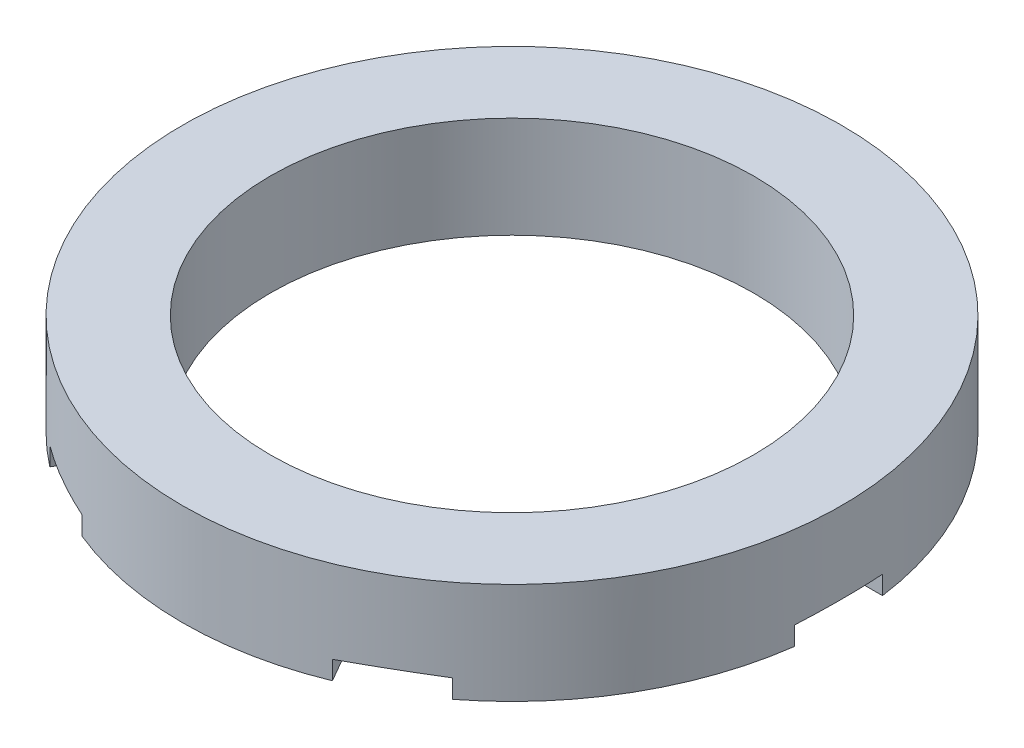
ISO-10303-21;
HEADER;
FILE_DESCRIPTION(('STEP AP214'),'2;1');
FILE_NAME('part.step','',(''),(''),'','','');
FILE_SCHEMA(('AUTOMOTIVE_DESIGN { 1 0 10303 214 1 1 1 1 }'));
ENDSEC;
DATA;
#1=APPLICATION_CONTEXT('core data for automotive mechanical design processes');
#2=APPLICATION_PROTOCOL_DEFINITION('international standard','automotive_design',2000,#1);
#3=PRODUCT_CONTEXT('',#1,'mechanical');
#4=PRODUCT('Part','Part','',(#3));
#5=PRODUCT_RELATED_PRODUCT_CATEGORY('part','',(#4));
#6=PRODUCT_DEFINITION_FORMATION('','',#4);
#7=PRODUCT_DEFINITION_CONTEXT('part definition',#1,'design');
#8=PRODUCT_DEFINITION('design','',#6,#7);
#9=PRODUCT_DEFINITION_SHAPE('','',#8);
#10=(LENGTH_UNIT() NAMED_UNIT(*) SI_UNIT(.MILLI.,.METRE.));
#11=(NAMED_UNIT(*) PLANE_ANGLE_UNIT() SI_UNIT($,.RADIAN.));
#12=(NAMED_UNIT(*) SI_UNIT($,.STERADIAN.) SOLID_ANGLE_UNIT());
#13=UNCERTAINTY_MEASURE_WITH_UNIT(LENGTH_MEASURE(1.E-05),#10,'distance_accuracy_value','');
#14=(GEOMETRIC_REPRESENTATION_CONTEXT(3) GLOBAL_UNCERTAINTY_ASSIGNED_CONTEXT((#13)) GLOBAL_UNIT_ASSIGNED_CONTEXT((#10,
#11,#12)) REPRESENTATION_CONTEXT('',''));
#15=CARTESIAN_POINT('',(0.,0.,0.));
#16=DIRECTION('',(0.,0.,1.));
#17=DIRECTION('',(1.,0.,0.));
#18=AXIS2_PLACEMENT_3D('',#15,#16,#17);
#19=CARTESIAN_POINT('',(0.,0.,0.));
#20=DIRECTION('',(0.,1.,0.));
#21=DIRECTION('',(0.,0.,1.));
#22=AXIS2_PLACEMENT_3D('',#19,#20,#21);
#23=PLANE('',#22);
#24=CARTESIAN_POINT('',(0.,0.,0.));
#25=DIRECTION('',(0.,1.,0.));
#26=DIRECTION('',(0.,0.,1.));
#27=AXIS2_PLACEMENT_3D('',#24,#25,#26);
#28=CIRCLE('',#27,27.5);
#29=CARTESIAN_POINT('',(0.,0.,27.5));
#30=VERTEX_POINT('',#29);
#31=EDGE_CURVE('E244',#30,#30,#28,.T.);
#32=ORIENTED_EDGE('',*,*,#31,.T.);
#33=EDGE_LOOP('',(#32));
#34=FACE_BOUND('',#33,.T.);
#35=DIRECTION('',(0.50000000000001,0.,0.866025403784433));
#36=VECTOR('',#35,1.);
#37=CARTESIAN_POINT('',(-12.4193542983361,0.,-31.5109526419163));
#38=LINE('',#37,#36);
#39=CARTESIAN_POINT('',(-14.2524589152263,0.,-34.6859829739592));
#40=VERTEX_POINT('',#39);
#41=CARTESIAN_POINT('',(-12.4193542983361,0.,-31.5109526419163));
#42=VERTEX_POINT('',#41);
#43=EDGE_CURVE('E159',#40,#42,#38,.T.);
#44=ORIENTED_EDGE('',*,*,#43,.F.);
#45=CARTESIAN_POINT('',(0.,0.,0.));
#46=DIRECTION('',(0.,1.,0.));
#47=DIRECTION('',(0.,0.,1.));
#48=AXIS2_PLACEMENT_3D('',#45,#46,#47);
#49=CIRCLE('',#48,37.5);
#50=CARTESIAN_POINT('',(14.2524589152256,0.,-34.6859829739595));
#51=VERTEX_POINT('',#50);
#52=EDGE_CURVE('E300',#51,#40,#49,.T.);
#53=ORIENTED_EDGE('',*,*,#52,.F.);
#54=DIRECTION('',(-0.499999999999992,0.,0.866025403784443));
#55=VECTOR('',#54,1.);
#56=CARTESIAN_POINT('',(12.4193542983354,0.,-31.5109526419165));
#57=LINE('',#56,#55);
#58=CARTESIAN_POINT('',(12.4193542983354,0.,-31.5109526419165));
#59=VERTEX_POINT('',#58);
#60=EDGE_CURVE('E56',#51,#59,#57,.T.);
#61=ORIENTED_EDGE('',*,*,#60,.T.);
#62=DIRECTION('',(-0.866025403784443,0.,-0.499999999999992));
#63=VECTOR('',#62,1.);
#64=CARTESIAN_POINT('',(21.0796083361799,0.,-26.5109526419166));
#65=LINE('',#64,#63);
#66=CARTESIAN_POINT('',(21.0796083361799,0.,-26.5109526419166));
#67=VERTEX_POINT('',#66);
#68=EDGE_CURVE('E187',#67,#59,#65,.T.);
#69=ORIENTED_EDGE('',*,*,#68,.F.);
#70=DIRECTION('',(-0.499999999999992,0.,0.866025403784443));
#71=VECTOR('',#70,1.);
#72=CARTESIAN_POINT('',(21.0796083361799,0.,-26.5109526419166));
#73=LINE('',#72,#71);
#74=CARTESIAN_POINT('',(22.9127129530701,0.,-29.6859829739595));
#75=VERTEX_POINT('',#74);
#76=EDGE_CURVE('E183',#75,#67,#73,.T.);
#77=ORIENTED_EDGE('',*,*,#76,.F.);
#78=CARTESIAN_POINT('',(37.1651718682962,0.,-5.00000000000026));
#79=VERTEX_POINT('',#78);
#80=EDGE_CURVE('E301',#79,#75,#49,.T.);
#81=ORIENTED_EDGE('',*,*,#80,.F.);
#82=DIRECTION('',(-1.,0.,0.));
#83=VECTOR('',#82,1.);
#84=CARTESIAN_POINT('',(33.4989626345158,0.,-5.00000000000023));
#85=LINE('',#84,#83);
#86=CARTESIAN_POINT('',(33.4989626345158,0.,-5.00000000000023));
#87=VERTEX_POINT('',#86);
#88=EDGE_CURVE('E192',#79,#87,#85,.T.);
#89=ORIENTED_EDGE('',*,*,#88,.T.);
#90=DIRECTION('',(0.,0.,-1.));
#91=VECTOR('',#90,1.);
#92=CARTESIAN_POINT('',(33.4989626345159,0.,4.99999999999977));
#93=LINE('',#92,#91);
#94=CARTESIAN_POINT('',(33.4989626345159,0.,4.99999999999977));
#95=VERTEX_POINT('',#94);
#96=EDGE_CURVE('E199',#95,#87,#93,.T.);
#97=ORIENTED_EDGE('',*,*,#96,.F.);
#98=DIRECTION('',(-1.,0.,0.));
#99=VECTOR('',#98,1.);
#100=CARTESIAN_POINT('',(33.4989626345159,0.,4.99999999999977));
#101=LINE('',#100,#99);
#102=CARTESIAN_POINT('',(37.1651718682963,0.,4.99999999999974));
#103=VERTEX_POINT('',#102);
#104=EDGE_CURVE('E193',#103,#95,#101,.T.);
#105=ORIENTED_EDGE('',*,*,#104,.F.);
#106=CARTESIAN_POINT('',(22.9127129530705,0.,29.6859829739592));
#107=VERTEX_POINT('',#106);
#108=EDGE_CURVE('E303',#107,#103,#49,.T.);
#109=ORIENTED_EDGE('',*,*,#108,.F.);
#110=DIRECTION('',(-0.500000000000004,0.,-0.866025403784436));
#111=VECTOR('',#110,1.);
#112=CARTESIAN_POINT('',(21.0796083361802,0.,26.5109526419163));
#113=LINE('',#112,#111);
#114=CARTESIAN_POINT('',(21.0796083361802,0.,26.5109526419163));
#115=VERTEX_POINT('',#114);
#116=EDGE_CURVE('E205',#107,#115,#113,.T.);
#117=ORIENTED_EDGE('',*,*,#116,.T.);
#118=DIRECTION('',(0.866025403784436,0.,-0.500000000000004));
#119=VECTOR('',#118,1.);
#120=CARTESIAN_POINT('',(12.4193542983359,0.,31.5109526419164));
#121=LINE('',#120,#119);
#122=CARTESIAN_POINT('',(12.4193542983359,0.,31.5109526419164));
#123=VERTEX_POINT('',#122);
#124=EDGE_CURVE('E212',#123,#115,#121,.T.);
#125=ORIENTED_EDGE('',*,*,#124,.F.);
#126=DIRECTION('',(-0.500000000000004,0.,-0.866025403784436));
#127=VECTOR('',#126,1.);
#128=CARTESIAN_POINT('',(12.4193542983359,0.,31.5109526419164));
#129=LINE('',#128,#127);
#130=CARTESIAN_POINT('',(14.2524589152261,0.,34.6859829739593));
#131=VERTEX_POINT('',#130);
#132=EDGE_CURVE('E206',#131,#123,#129,.T.);
#133=ORIENTED_EDGE('',*,*,#132,.F.);
#134=CARTESIAN_POINT('',(-14.2524589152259,0.,34.6859829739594));
#135=VERTEX_POINT('',#134);
#136=EDGE_CURVE('E258',#135,#131,#49,.T.);
#137=ORIENTED_EDGE('',*,*,#136,.F.);
#138=DIRECTION('',(0.499999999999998,0.,-0.86602540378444));
#139=VECTOR('',#138,1.);
#140=CARTESIAN_POINT('',(-12.4193542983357,0.,31.5109526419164));
#141=LINE('',#140,#139);
#142=CARTESIAN_POINT('',(-12.4193542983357,0.,31.5109526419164));
#143=VERTEX_POINT('',#142);
#144=EDGE_CURVE('E218',#135,#143,#141,.T.);
#145=ORIENTED_EDGE('',*,*,#144,.T.);
#146=DIRECTION('',(0.86602540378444,0.,0.499999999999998));
#147=VECTOR('',#146,1.);
#148=CARTESIAN_POINT('',(-21.0796083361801,0.,26.5109526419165));
#149=LINE('',#148,#147);
#150=CARTESIAN_POINT('',(-21.0796083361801,0.,26.5109526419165));
#151=VERTEX_POINT('',#150);
#152=EDGE_CURVE('E225',#151,#143,#149,.T.);
#153=ORIENTED_EDGE('',*,*,#152,.F.);
#154=DIRECTION('',(0.499999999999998,0.,-0.86602540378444));
#155=VECTOR('',#154,1.);
#156=CARTESIAN_POINT('',(-21.0796083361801,0.,26.5109526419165));
#157=LINE('',#156,#155);
#158=CARTESIAN_POINT('',(-22.9127129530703,0.,29.6859829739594));
#159=VERTEX_POINT('',#158);
#160=EDGE_CURVE('E219',#159,#151,#157,.T.);
#161=ORIENTED_EDGE('',*,*,#160,.F.);
#162=CARTESIAN_POINT('',(-37.1651718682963,0.,5.));
#163=VERTEX_POINT('',#162);
#164=EDGE_CURVE('E255',#163,#159,#49,.T.);
#165=ORIENTED_EDGE('',*,*,#164,.F.);
#166=DIRECTION('',(1.,0.,0.));
#167=VECTOR('',#166,1.);
#168=CARTESIAN_POINT('',(-33.4989626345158,0.,5.));
#169=LINE('',#168,#167);
#170=CARTESIAN_POINT('',(-33.4989626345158,0.,5.));
#171=VERTEX_POINT('',#170);
#172=EDGE_CURVE('E231',#163,#171,#169,.T.);
#173=ORIENTED_EDGE('',*,*,#172,.T.);
#174=DIRECTION('',(0.,0.,1.));
#175=VECTOR('',#174,1.);
#176=CARTESIAN_POINT('',(-33.4989626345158,0.,-5.));
#177=LINE('',#176,#175);
#178=CARTESIAN_POINT('',(-33.4989626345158,0.,-5.));
#179=VERTEX_POINT('',#178);
#180=EDGE_CURVE('E238',#179,#171,#177,.T.);
#181=ORIENTED_EDGE('',*,*,#180,.F.);
#182=DIRECTION('',(1.,0.,0.));
#183=VECTOR('',#182,1.);
#184=CARTESIAN_POINT('',(-33.4989626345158,0.,-5.));
#185=LINE('',#184,#183);
#186=CARTESIAN_POINT('',(-37.1651718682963,0.,-5.));
#187=VERTEX_POINT('',#186);
#188=EDGE_CURVE('E232',#187,#179,#185,.T.);
#189=ORIENTED_EDGE('',*,*,#188,.F.);
#190=CARTESIAN_POINT('',(-22.9127129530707,0.,-29.6859829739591));
#191=VERTEX_POINT('',#190);
#192=EDGE_CURVE('E248',#191,#187,#49,.T.);
#193=ORIENTED_EDGE('',*,*,#192,.F.);
#194=DIRECTION('',(0.50000000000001,0.,0.866025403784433));
#195=VECTOR('',#194,1.);
#196=CARTESIAN_POINT('',(-21.0796083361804,0.,-26.5109526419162));
#197=LINE('',#196,#195);
#198=CARTESIAN_POINT('',(-21.0796083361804,0.,-26.5109526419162));
#199=VERTEX_POINT('',#198);
#200=EDGE_CURVE('E48',#191,#199,#197,.T.);
#201=ORIENTED_EDGE('',*,*,#200,.T.);
#202=DIRECTION('',(-0.866025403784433,0.,0.50000000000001));
#203=VECTOR('',#202,1.);
#204=CARTESIAN_POINT('',(-12.4193542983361,0.,-31.5109526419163));
#205=LINE('',#204,#203);
#206=EDGE_CURVE('E173',#42,#199,#205,.T.);
#207=ORIENTED_EDGE('',*,*,#206,.F.);
#208=EDGE_LOOP('',(#44,#53,#61,#69,#77,#81,#89,#97,#105,#109,#117,#125,#133,#137,#145,#153,#161,
#165,#173,#181,#189,#193,#201,#207));
#209=FACE_BOUND('',#208,.T.);
#210=ADVANCED_FACE('F33',(#34,#209),#23,.F.);
#211=CARTESIAN_POINT('',(0.,11.54,0.));
#212=DIRECTION('',(0.,-1.,0.));
#213=DIRECTION('',(0.,0.,-1.));
#214=AXIS2_PLACEMENT_3D('',#211,#212,#213);
#215=CYLINDRICAL_SURFACE('',#214,37.5);
#216=CARTESIAN_POINT('',(0.,11.54,0.));
#217=DIRECTION('',(0.,1.,0.));
#218=DIRECTION('',(0.,0.,1.));
#219=AXIS2_PLACEMENT_3D('',#216,#217,#218);
#220=CIRCLE('',#219,37.5);
#221=CARTESIAN_POINT('',(0.,11.54,37.5));
#222=VERTEX_POINT('',#221);
#223=EDGE_CURVE('E251',#222,#222,#220,.T.);
#224=ORIENTED_EDGE('',*,*,#223,.F.);
#225=EDGE_LOOP('',(#224));
#226=FACE_BOUND('',#225,.T.);
#227=DIRECTION('',(0.,-1.,0.));
#228=VECTOR('',#227,1.);
#229=CARTESIAN_POINT('',(-14.2524589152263,11.54,-34.6859829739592));
#230=LINE('',#229,#228);
#231=CARTESIAN_POINT('',(-14.2524589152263,2.11668688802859,-34.6859829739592));
#232=VERTEX_POINT('',#231);
#233=EDGE_CURVE('E11',#232,#40,#230,.T.);
#234=ORIENTED_EDGE('',*,*,#233,.F.);
#235=CARTESIAN_POINT('',(0.,-19.3406350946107,0.));
#236=DIRECTION('',(0.250000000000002,0.866025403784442,0.433012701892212));
#237=DIRECTION('',(0.43301270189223,-0.499999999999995,0.749999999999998));
#238=AXIS2_PLACEMENT_3D('',#235,#236,#237);
#239=ELLIPSE('',#238,43.3012701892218,37.5);
#240=CARTESIAN_POINT('',(-22.9127129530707,2.11668688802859,-29.6859829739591));
#241=VERTEX_POINT('',#240);
#242=EDGE_CURVE('E41',#232,#241,#239,.T.);
#243=ORIENTED_EDGE('',*,*,#242,.T.);
#244=DIRECTION('',(0.,-1.,0.));
#245=VECTOR('',#244,1.);
#246=CARTESIAN_POINT('',(-22.9127129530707,11.54,-29.6859829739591));
#247=LINE('',#246,#245);
#248=EDGE_CURVE('E298',#241,#191,#247,.T.);
#249=ORIENTED_EDGE('',*,*,#248,.T.);
#250=ORIENTED_EDGE('',*,*,#192,.T.);
#251=DIRECTION('',(0.,-1.,0.));
#252=VECTOR('',#251,1.);
#253=CARTESIAN_POINT('',(-37.1651718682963,11.54,-5.));
#254=LINE('',#253,#252);
#255=CARTESIAN_POINT('',(-37.1651718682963,2.11668688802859,-5.));
#256=VERTEX_POINT('',#255);
#257=EDGE_CURVE('E264',#256,#187,#254,.T.);
#258=ORIENTED_EDGE('',*,*,#257,.F.);
#259=CARTESIAN_POINT('',(0.,-19.3406350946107,0.));
#260=DIRECTION('',(0.499999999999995,0.866025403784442,0.));
#261=DIRECTION('',(0.866025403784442,-0.499999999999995,0.));
#262=AXIS2_PLACEMENT_3D('',#259,#260,#261);
#263=ELLIPSE('',#262,43.3012701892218,37.5);
#264=CARTESIAN_POINT('',(-37.1651718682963,2.11668688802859,5.));
#265=VERTEX_POINT('',#264);
#266=EDGE_CURVE('E261',#256,#265,#263,.T.);
#267=ORIENTED_EDGE('',*,*,#266,.T.);
#268=DIRECTION('',(0.,-1.,0.));
#269=VECTOR('',#268,1.);
#270=CARTESIAN_POINT('',(-37.1651718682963,11.54,5.));
#271=LINE('',#270,#269);
#272=EDGE_CURVE('E254',#265,#163,#271,.T.);
#273=ORIENTED_EDGE('',*,*,#272,.T.);
#274=ORIENTED_EDGE('',*,*,#164,.T.);
#275=DIRECTION('',(0.,-1.,0.));
#276=VECTOR('',#275,1.);
#277=CARTESIAN_POINT('',(-22.9127129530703,11.54,29.6859829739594));
#278=LINE('',#277,#276);
#279=CARTESIAN_POINT('',(-22.9127129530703,2.11668688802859,29.6859829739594));
#280=VERTEX_POINT('',#279);
#281=EDGE_CURVE('E273',#280,#159,#278,.T.);
#282=ORIENTED_EDGE('',*,*,#281,.F.);
#283=CARTESIAN_POINT('',(0.,-19.3406350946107,0.));
#284=DIRECTION('',(0.249999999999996,0.866025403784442,-0.433012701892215));
#285=DIRECTION('',(0.433012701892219,-0.499999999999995,-0.750000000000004));
#286=AXIS2_PLACEMENT_3D('',#283,#284,#285);
#287=ELLIPSE('',#286,43.3012701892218,37.5);
#288=CARTESIAN_POINT('',(-14.2524589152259,2.11668688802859,34.6859829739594));
#289=VERTEX_POINT('',#288);
#290=EDGE_CURVE('E270',#280,#289,#287,.T.);
#291=ORIENTED_EDGE('',*,*,#290,.T.);
#292=DIRECTION('',(0.,-1.,0.));
#293=VECTOR('',#292,1.);
#294=CARTESIAN_POINT('',(-14.2524589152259,11.54,34.6859829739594));
#295=LINE('',#294,#293);
#296=EDGE_CURVE('E267',#289,#135,#295,.T.);
#297=ORIENTED_EDGE('',*,*,#296,.T.);
#298=ORIENTED_EDGE('',*,*,#136,.T.);
#299=DIRECTION('',(0.,-1.,0.));
#300=VECTOR('',#299,1.);
#301=CARTESIAN_POINT('',(14.2524589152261,11.54,34.6859829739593));
#302=LINE('',#301,#300);
#303=CARTESIAN_POINT('',(14.2524589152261,2.11668688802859,34.6859829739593));
#304=VERTEX_POINT('',#303);
#305=EDGE_CURVE('E281',#304,#131,#302,.T.);
#306=ORIENTED_EDGE('',*,*,#305,.F.);
#307=CARTESIAN_POINT('',(0.,-19.3406350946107,0.));
#308=DIRECTION('',(-0.249999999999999,0.866025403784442,-0.433012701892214));
#309=DIRECTION('',(-0.433012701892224,-0.499999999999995,-0.750000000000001));
#310=AXIS2_PLACEMENT_3D('',#307,#308,#309);
#311=ELLIPSE('',#310,43.3012701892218,37.5);
#312=CARTESIAN_POINT('',(22.9127129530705,2.11668688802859,29.6859829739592));
#313=VERTEX_POINT('',#312);
#314=EDGE_CURVE('E278',#304,#313,#311,.T.);
#315=ORIENTED_EDGE('',*,*,#314,.T.);
#316=DIRECTION('',(0.,-1.,0.));
#317=VECTOR('',#316,1.);
#318=CARTESIAN_POINT('',(22.9127129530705,11.54,29.6859829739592));
#319=LINE('',#318,#317);
#320=EDGE_CURVE('E275',#313,#107,#319,.T.);
#321=ORIENTED_EDGE('',*,*,#320,.T.);
#322=ORIENTED_EDGE('',*,*,#108,.T.);
#323=DIRECTION('',(0.,-1.,0.));
#324=VECTOR('',#323,1.);
#325=CARTESIAN_POINT('',(37.1651718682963,11.54,4.99999999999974));
#326=LINE('',#325,#324);
#327=CARTESIAN_POINT('',(37.1651718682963,2.11668688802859,4.99999999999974));
#328=VERTEX_POINT('',#327);
#329=EDGE_CURVE('E289',#328,#103,#326,.T.);
#330=ORIENTED_EDGE('',*,*,#329,.F.);
#331=CARTESIAN_POINT('',(0.,-19.3406350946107,0.));
#332=DIRECTION('',(-0.499999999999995,0.866025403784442,0.));
#333=DIRECTION('',(-0.866025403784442,-0.499999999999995,0.));
#334=AXIS2_PLACEMENT_3D('',#331,#332,#333);
#335=ELLIPSE('',#334,43.3012701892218,37.5);
#336=CARTESIAN_POINT('',(37.1651718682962,2.11668688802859,-5.00000000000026));
#337=VERTEX_POINT('',#336);
#338=EDGE_CURVE('E286',#328,#337,#335,.T.);
#339=ORIENTED_EDGE('',*,*,#338,.T.);
#340=DIRECTION('',(0.,-1.,0.));
#341=VECTOR('',#340,1.);
#342=CARTESIAN_POINT('',(37.1651718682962,11.54,-5.00000000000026));
#343=LINE('',#342,#341);
#344=EDGE_CURVE('E283',#337,#79,#343,.T.);
#345=ORIENTED_EDGE('',*,*,#344,.T.);
#346=ORIENTED_EDGE('',*,*,#80,.T.);
#347=DIRECTION('',(0.,-1.,0.));
#348=VECTOR('',#347,1.);
#349=CARTESIAN_POINT('',(22.9127129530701,11.54,-29.6859829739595));
#350=LINE('',#349,#348);
#351=CARTESIAN_POINT('',(22.9127129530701,2.11668688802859,-29.6859829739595));
#352=VERTEX_POINT('',#351);
#353=EDGE_CURVE('E296',#352,#75,#350,.T.);
#354=ORIENTED_EDGE('',*,*,#353,.F.);
#355=CARTESIAN_POINT('',(0.,-19.3406350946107,0.));
#356=DIRECTION('',(-0.249999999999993,0.866025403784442,0.433012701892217));
#357=DIRECTION('',(-0.433012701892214,-0.499999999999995,0.750000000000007));
#358=AXIS2_PLACEMENT_3D('',#355,#356,#357);
#359=ELLIPSE('',#358,43.3012701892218,37.5);
#360=CARTESIAN_POINT('',(14.2524589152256,2.11668688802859,-34.6859829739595));
#361=VERTEX_POINT('',#360);
#362=EDGE_CURVE('E293',#352,#361,#359,.T.);
#363=ORIENTED_EDGE('',*,*,#362,.T.);
#364=DIRECTION('',(0.,-1.,0.));
#365=VECTOR('',#364,1.);
#366=CARTESIAN_POINT('',(14.2524589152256,11.54,-34.6859829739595));
#367=LINE('',#366,#365);
#368=EDGE_CURVE('E291',#361,#51,#367,.T.);
#369=ORIENTED_EDGE('',*,*,#368,.T.);
#370=ORIENTED_EDGE('',*,*,#52,.T.);
#371=EDGE_LOOP('',(#234,#243,#249,#250,#258,#267,#273,#274,#282,#291,#297,#298,#306,#315,#321,
#322,#330,#339,#345,#346,#354,#363,#369,#370));
#372=FACE_BOUND('',#371,.T.);
#373=ADVANCED_FACE('F35',(#226,#372),#215,.T.);
#374=CARTESIAN_POINT('',(0.,11.54,0.));
#375=DIRECTION('',(0.,1.,0.));
#376=DIRECTION('',(0.,0.,1.));
#377=AXIS2_PLACEMENT_3D('',#374,#375,#376);
#378=PLANE('',#377);
#379=ORIENTED_EDGE('',*,*,#223,.T.);
#380=EDGE_LOOP('',(#379));
#381=FACE_BOUND('',#380,.T.);
#382=CARTESIAN_POINT('',(0.,11.54,0.));
#383=DIRECTION('',(0.,1.,0.));
#384=DIRECTION('',(0.,0.,1.));
#385=AXIS2_PLACEMENT_3D('',#382,#383,#384);
#386=CIRCLE('',#385,27.5);
#387=CARTESIAN_POINT('',(0.,11.54,27.5));
#388=VERTEX_POINT('',#387);
#389=EDGE_CURVE('E245',#388,#388,#386,.T.);
#390=ORIENTED_EDGE('',*,*,#389,.F.);
#391=EDGE_LOOP('',(#390));
#392=FACE_BOUND('',#391,.T.);
#393=ADVANCED_FACE('F367',(#381,#392),#378,.T.);
#394=CARTESIAN_POINT('',(0.,11.54,0.));
#395=DIRECTION('',(0.,-1.,0.));
#396=DIRECTION('',(0.,0.,-1.));
#397=AXIS2_PLACEMENT_3D('',#394,#395,#396);
#398=CYLINDRICAL_SURFACE('',#397,27.5);
#399=ORIENTED_EDGE('',*,*,#389,.T.);
#400=EDGE_LOOP('',(#399));
#401=FACE_BOUND('',#400,.T.);
#402=ORIENTED_EDGE('',*,*,#31,.F.);
#403=EDGE_LOOP('',(#402));
#404=FACE_BOUND('',#403,.T.);
#405=ADVANCED_FACE('F372',(#401,#404),#398,.F.);
#406=CARTESIAN_POINT('',(-37.5,2.31,-5.));
#407=DIRECTION('',(0.499999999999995,0.866025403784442,0.));
#408=DIRECTION('',(-0.866025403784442,0.499999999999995,0.));
#409=AXIS2_PLACEMENT_3D('',#406,#407,#408);
#410=PLANE('',#409);
#411=DIRECTION('',(-0.866025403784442,0.499999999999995,0.));
#412=VECTOR('',#411,1.);
#413=CARTESIAN_POINT('',(-37.5,2.31,-5.));
#414=LINE('',#413,#412);
#415=EDGE_CURVE('E234',#179,#256,#414,.T.);
#416=ORIENTED_EDGE('',*,*,#415,.F.);
#417=ORIENTED_EDGE('',*,*,#180,.T.);
#418=DIRECTION('',(-0.866025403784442,0.499999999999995,0.));
#419=VECTOR('',#418,1.);
#420=CARTESIAN_POINT('',(-37.5,2.31,5.));
#421=LINE('',#420,#419);
#422=EDGE_CURVE('E235',#171,#265,#421,.T.);
#423=ORIENTED_EDGE('',*,*,#422,.T.);
#424=ORIENTED_EDGE('',*,*,#266,.F.);
#425=EDGE_LOOP('',(#416,#417,#423,#424));
#426=FACE_BOUND('',#425,.T.);
#427=ADVANCED_FACE('F313',(#426),#410,.F.);
#428=CARTESIAN_POINT('',(-37.5,0.,-5.));
#429=DIRECTION('',(0.,0.,1.));
#430=DIRECTION('',(1.,0.,0.));
#431=AXIS2_PLACEMENT_3D('',#428,#429,#430);
#432=PLANE('',#431);
#433=ORIENTED_EDGE('',*,*,#257,.T.);
#434=ORIENTED_EDGE('',*,*,#188,.T.);
#435=ORIENTED_EDGE('',*,*,#415,.T.);
#436=EDGE_LOOP('',(#433,#434,#435));
#437=FACE_BOUND('',#436,.T.);
#438=ADVANCED_FACE('F307',(#437),#432,.T.);
#439=CARTESIAN_POINT('',(-37.5,0.,5.));
#440=DIRECTION('',(0.,0.,1.));
#441=DIRECTION('',(1.,0.,0.));
#442=AXIS2_PLACEMENT_3D('',#439,#440,#441);
#443=PLANE('',#442);
#444=ORIENTED_EDGE('',*,*,#422,.F.);
#445=ORIENTED_EDGE('',*,*,#172,.F.);
#446=ORIENTED_EDGE('',*,*,#272,.F.);
#447=EDGE_LOOP('',(#444,#445,#446));
#448=FACE_BOUND('',#447,.T.);
#449=ADVANCED_FACE('F315',(#448),#443,.F.);
#450=CARTESIAN_POINT('',(-23.0801270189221,2.31,29.9759526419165));
#451=DIRECTION('',(0.249999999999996,0.866025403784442,-0.433012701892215));
#452=DIRECTION('',(0.,0.447213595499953,0.894427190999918));
#453=AXIS2_PLACEMENT_3D('',#450,#451,#452);
#454=PLANE('',#453);
#455=DIRECTION('',(-0.433012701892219,0.499999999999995,0.750000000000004));
#456=VECTOR('',#455,1.);
#457=CARTESIAN_POINT('',(-23.0801270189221,2.31,29.9759526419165));
#458=LINE('',#457,#456);
#459=EDGE_CURVE('E221',#151,#280,#458,.T.);
#460=ORIENTED_EDGE('',*,*,#459,.F.);
#461=ORIENTED_EDGE('',*,*,#152,.T.);
#462=DIRECTION('',(-0.433012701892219,0.499999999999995,0.750000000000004));
#463=VECTOR('',#462,1.);
#464=CARTESIAN_POINT('',(-14.4198729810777,2.31,34.9759526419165));
#465=LINE('',#464,#463);
#466=EDGE_CURVE('E222',#143,#289,#465,.T.);
#467=ORIENTED_EDGE('',*,*,#466,.T.);
#468=ORIENTED_EDGE('',*,*,#290,.F.);
#469=EDGE_LOOP('',(#460,#461,#467,#468));
#470=FACE_BOUND('',#469,.T.);
#471=ADVANCED_FACE('F323',(#470),#454,.F.);
#472=CARTESIAN_POINT('',(-23.0801270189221,0.,29.9759526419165));
#473=DIRECTION('',(0.86602540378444,0.,0.499999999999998));
#474=DIRECTION('',(0.499999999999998,0.,-0.86602540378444));
#475=AXIS2_PLACEMENT_3D('',#472,#473,#474);
#476=PLANE('',#475);
#477=ORIENTED_EDGE('',*,*,#281,.T.);
#478=ORIENTED_EDGE('',*,*,#160,.T.);
#479=ORIENTED_EDGE('',*,*,#459,.T.);
#480=EDGE_LOOP('',(#477,#478,#479));
#481=FACE_BOUND('',#480,.T.);
#482=ADVANCED_FACE('F321',(#481),#476,.T.);
#483=CARTESIAN_POINT('',(-14.4198729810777,0.,34.9759526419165));
#484=DIRECTION('',(0.86602540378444,0.,0.499999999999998));
#485=DIRECTION('',(0.499999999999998,0.,-0.86602540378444));
#486=AXIS2_PLACEMENT_3D('',#483,#484,#485);
#487=PLANE('',#486);
#488=ORIENTED_EDGE('',*,*,#466,.F.);
#489=ORIENTED_EDGE('',*,*,#144,.F.);
#490=ORIENTED_EDGE('',*,*,#296,.F.);
#491=EDGE_LOOP('',(#488,#489,#490));
#492=FACE_BOUND('',#491,.T.);
#493=ADVANCED_FACE('F385',(#492),#487,.F.);
#494=CARTESIAN_POINT('',(14.419872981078,2.31,34.9759526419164));
#495=DIRECTION('',(-0.249999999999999,0.866025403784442,-0.433012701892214));
#496=DIRECTION('',(0.,0.447213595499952,0.894427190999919));
#497=AXIS2_PLACEMENT_3D('',#494,#495,#496);
#498=PLANE('',#497);
#499=DIRECTION('',(0.433012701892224,0.499999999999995,0.750000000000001));
#500=VECTOR('',#499,1.);
#501=CARTESIAN_POINT('',(14.419872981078,2.31,34.9759526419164));
#502=LINE('',#501,#500);
#503=EDGE_CURVE('E208',#123,#304,#502,.T.);
#504=ORIENTED_EDGE('',*,*,#503,.F.);
#505=ORIENTED_EDGE('',*,*,#124,.T.);
#506=DIRECTION('',(0.433012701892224,0.499999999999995,0.750000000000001));
#507=VECTOR('',#506,1.);
#508=CARTESIAN_POINT('',(23.0801270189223,2.31,29.9759526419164));
#509=LINE('',#508,#507);
#510=EDGE_CURVE('E209',#115,#313,#509,.T.);
#511=ORIENTED_EDGE('',*,*,#510,.T.);
#512=ORIENTED_EDGE('',*,*,#314,.F.);
#513=EDGE_LOOP('',(#504,#505,#511,#512));
#514=FACE_BOUND('',#513,.T.);
#515=ADVANCED_FACE('F388',(#514),#498,.F.);
#516=CARTESIAN_POINT('',(14.419872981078,0.,34.9759526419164));
#517=DIRECTION('',(0.866025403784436,0.,-0.500000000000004));
#518=DIRECTION('',(-0.500000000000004,0.,-0.866025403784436));
#519=AXIS2_PLACEMENT_3D('',#516,#517,#518);
#520=PLANE('',#519);
#521=ORIENTED_EDGE('',*,*,#305,.T.);
#522=ORIENTED_EDGE('',*,*,#132,.T.);
#523=ORIENTED_EDGE('',*,*,#503,.T.);
#524=EDGE_LOOP('',(#521,#522,#523));
#525=FACE_BOUND('',#524,.T.);
#526=ADVANCED_FACE('F393',(#525),#520,.T.);
#527=CARTESIAN_POINT('',(23.0801270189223,0.,29.9759526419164));
#528=DIRECTION('',(0.866025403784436,0.,-0.500000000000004));
#529=DIRECTION('',(-0.500000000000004,0.,-0.866025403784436));
#530=AXIS2_PLACEMENT_3D('',#527,#528,#529);
#531=PLANE('',#530);
#532=ORIENTED_EDGE('',*,*,#510,.F.);
#533=ORIENTED_EDGE('',*,*,#116,.F.);
#534=ORIENTED_EDGE('',*,*,#320,.F.);
#535=EDGE_LOOP('',(#532,#533,#534));
#536=FACE_BOUND('',#535,.T.);
#537=ADVANCED_FACE('F395',(#536),#531,.F.);
#538=CARTESIAN_POINT('',(37.5,2.31,4.99999999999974));
#539=DIRECTION('',(-0.499999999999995,0.866025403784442,0.));
#540=DIRECTION('',(-0.866025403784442,-0.499999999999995,0.));
#541=AXIS2_PLACEMENT_3D('',#538,#539,#540);
#542=PLANE('',#541);
#543=DIRECTION('',(0.866025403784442,0.499999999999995,0.));
#544=VECTOR('',#543,1.);
#545=CARTESIAN_POINT('',(37.5,2.31,4.99999999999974));
#546=LINE('',#545,#544);
#547=EDGE_CURVE('E195',#95,#328,#546,.T.);
#548=ORIENTED_EDGE('',*,*,#547,.F.);
#549=ORIENTED_EDGE('',*,*,#96,.T.);
#550=DIRECTION('',(0.866025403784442,0.499999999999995,0.));
#551=VECTOR('',#550,1.);
#552=CARTESIAN_POINT('',(37.5,2.31,-5.00000000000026));
#553=LINE('',#552,#551);
#554=EDGE_CURVE('E196',#87,#337,#553,.T.);
#555=ORIENTED_EDGE('',*,*,#554,.T.);
#556=ORIENTED_EDGE('',*,*,#338,.F.);
#557=EDGE_LOOP('',(#548,#549,#555,#556));
#558=FACE_BOUND('',#557,.T.);
#559=ADVANCED_FACE('F340',(#558),#542,.F.);
#560=CARTESIAN_POINT('',(37.5,0.,4.99999999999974));
#561=DIRECTION('',(0.,0.,-1.));
#562=DIRECTION('',(-1.,0.,0.));
#563=AXIS2_PLACEMENT_3D('',#560,#561,#562);
#564=PLANE('',#563);
#565=ORIENTED_EDGE('',*,*,#329,.T.);
#566=ORIENTED_EDGE('',*,*,#104,.T.);
#567=ORIENTED_EDGE('',*,*,#547,.T.);
#568=EDGE_LOOP('',(#565,#566,#567));
#569=FACE_BOUND('',#568,.T.);
#570=ADVANCED_FACE('F338',(#569),#564,.T.);
#571=CARTESIAN_POINT('',(37.5,0.,-5.00000000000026));
#572=DIRECTION('',(0.,0.,-1.));
#573=DIRECTION('',(-1.,0.,0.));
#574=AXIS2_PLACEMENT_3D('',#571,#572,#573);
#575=PLANE('',#574);
#576=ORIENTED_EDGE('',*,*,#554,.F.);
#577=ORIENTED_EDGE('',*,*,#88,.F.);
#578=ORIENTED_EDGE('',*,*,#344,.F.);
#579=EDGE_LOOP('',(#576,#577,#578));
#580=FACE_BOUND('',#579,.T.);
#581=ADVANCED_FACE('F404',(#580),#575,.F.);
#582=CARTESIAN_POINT('',(23.0801270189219,2.31,-29.9759526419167));
#583=DIRECTION('',(-0.249999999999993,0.866025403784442,0.433012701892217));
#584=DIRECTION('',(0.,-0.447213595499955,0.894427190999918));
#585=AXIS2_PLACEMENT_3D('',#582,#583,#584);
#586=PLANE('',#585);
#587=DIRECTION('',(0.433012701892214,0.499999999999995,-0.750000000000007));
#588=VECTOR('',#587,1.);
#589=CARTESIAN_POINT('',(23.0801270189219,2.31,-29.9759526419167));
#590=LINE('',#589,#588);
#591=EDGE_CURVE('E185',#67,#352,#590,.T.);
#592=ORIENTED_EDGE('',*,*,#591,.F.);
#593=ORIENTED_EDGE('',*,*,#68,.T.);
#594=DIRECTION('',(0.433012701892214,0.499999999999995,-0.750000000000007));
#595=VECTOR('',#594,1.);
#596=CARTESIAN_POINT('',(14.4198729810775,2.31,-34.9759526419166));
#597=LINE('',#596,#595);
#598=EDGE_CURVE('E178',#59,#361,#597,.T.);
#599=ORIENTED_EDGE('',*,*,#598,.T.);
#600=ORIENTED_EDGE('',*,*,#362,.F.);
#601=EDGE_LOOP('',(#592,#593,#599,#600));
#602=FACE_BOUND('',#601,.T.);
#603=ADVANCED_FACE('F351',(#602),#586,.F.);
#604=CARTESIAN_POINT('',(23.0801270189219,0.,-29.9759526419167));
#605=DIRECTION('',(-0.866025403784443,0.,-0.499999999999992));
#606=DIRECTION('',(-0.499999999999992,0.,0.866025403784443));
#607=AXIS2_PLACEMENT_3D('',#604,#605,#606);
#608=PLANE('',#607);
#609=ORIENTED_EDGE('',*,*,#353,.T.);
#610=ORIENTED_EDGE('',*,*,#76,.T.);
#611=ORIENTED_EDGE('',*,*,#591,.T.);
#612=EDGE_LOOP('',(#609,#610,#611));
#613=FACE_BOUND('',#612,.T.);
#614=ADVANCED_FACE('F349',(#613),#608,.T.);
#615=CARTESIAN_POINT('',(14.4198729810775,0.,-34.9759526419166));
#616=DIRECTION('',(-0.866025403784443,0.,-0.499999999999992));
#617=DIRECTION('',(-0.499999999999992,0.,0.866025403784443));
#618=AXIS2_PLACEMENT_3D('',#615,#616,#617);
#619=PLANE('',#618);
#620=ORIENTED_EDGE('',*,*,#598,.F.);
#621=ORIENTED_EDGE('',*,*,#60,.F.);
#622=ORIENTED_EDGE('',*,*,#368,.F.);
#623=EDGE_LOOP('',(#620,#621,#622));
#624=FACE_BOUND('',#623,.T.);
#625=ADVANCED_FACE('F352',(#624),#619,.F.);
#626=CARTESIAN_POINT('',(-14.4198729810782,2.31,-34.9759526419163));
#627=DIRECTION('',(0.250000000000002,0.866025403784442,0.433012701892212));
#628=DIRECTION('',(0.,-0.44721359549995,0.894427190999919));
#629=AXIS2_PLACEMENT_3D('',#626,#627,#628);
#630=PLANE('',#629);
#631=DIRECTION('',(-0.43301270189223,0.499999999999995,-0.749999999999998));
#632=VECTOR('',#631,1.);
#633=CARTESIAN_POINT('',(-14.4198729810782,2.31,-34.9759526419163));
#634=LINE('',#633,#632);
#635=EDGE_CURVE('E162',#42,#232,#634,.T.);
#636=ORIENTED_EDGE('',*,*,#635,.F.);
#637=ORIENTED_EDGE('',*,*,#206,.T.);
#638=DIRECTION('',(-0.43301270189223,0.499999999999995,-0.749999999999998));
#639=VECTOR('',#638,1.);
#640=CARTESIAN_POINT('',(-23.0801270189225,2.31,-29.9759526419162));
#641=LINE('',#640,#639);
#642=EDGE_CURVE('E168',#199,#241,#641,.T.);
#643=ORIENTED_EDGE('',*,*,#642,.T.);
#644=ORIENTED_EDGE('',*,*,#242,.F.);
#645=EDGE_LOOP('',(#636,#637,#643,#644));
#646=FACE_BOUND('',#645,.T.);
#647=ADVANCED_FACE('F171',(#646),#630,.F.);
#648=CARTESIAN_POINT('',(-14.4198729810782,0.,-34.9759526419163));
#649=DIRECTION('',(-0.866025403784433,0.,0.50000000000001));
#650=DIRECTION('',(0.50000000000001,0.,0.866025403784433));
#651=AXIS2_PLACEMENT_3D('',#648,#649,#650);
#652=PLANE('',#651);
#653=ORIENTED_EDGE('',*,*,#233,.T.);
#654=ORIENTED_EDGE('',*,*,#43,.T.);
#655=ORIENTED_EDGE('',*,*,#635,.T.);
#656=EDGE_LOOP('',(#653,#654,#655));
#657=FACE_BOUND('',#656,.T.);
#658=ADVANCED_FACE('F161',(#657),#652,.T.);
#659=CARTESIAN_POINT('',(-23.0801270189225,0.,-29.9759526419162));
#660=DIRECTION('',(-0.866025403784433,0.,0.50000000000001));
#661=DIRECTION('',(0.50000000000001,0.,0.866025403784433));
#662=AXIS2_PLACEMENT_3D('',#659,#660,#661);
#663=PLANE('',#662);
#664=ORIENTED_EDGE('',*,*,#642,.F.);
#665=ORIENTED_EDGE('',*,*,#200,.F.);
#666=ORIENTED_EDGE('',*,*,#248,.F.);
#667=EDGE_LOOP('',(#664,#665,#666));
#668=FACE_BOUND('',#667,.T.);
#669=ADVANCED_FACE('F436',(#668),#663,.F.);
#670=CLOSED_SHELL('',(#210,#373,#393,#405,#427,#438,#449,#471,#482,#493,#515,#526,#537,#559,
#570,#581,#603,#614,#625,#647,#658,#669));
#671=MANIFOLD_SOLID_BREP('B2',#670);
#672=ADVANCED_BREP_SHAPE_REPRESENTATION('',(#18,#671),#14);
#673=SHAPE_DEFINITION_REPRESENTATION(#9,#672);
ENDSEC;
END-ISO-10303-21;
